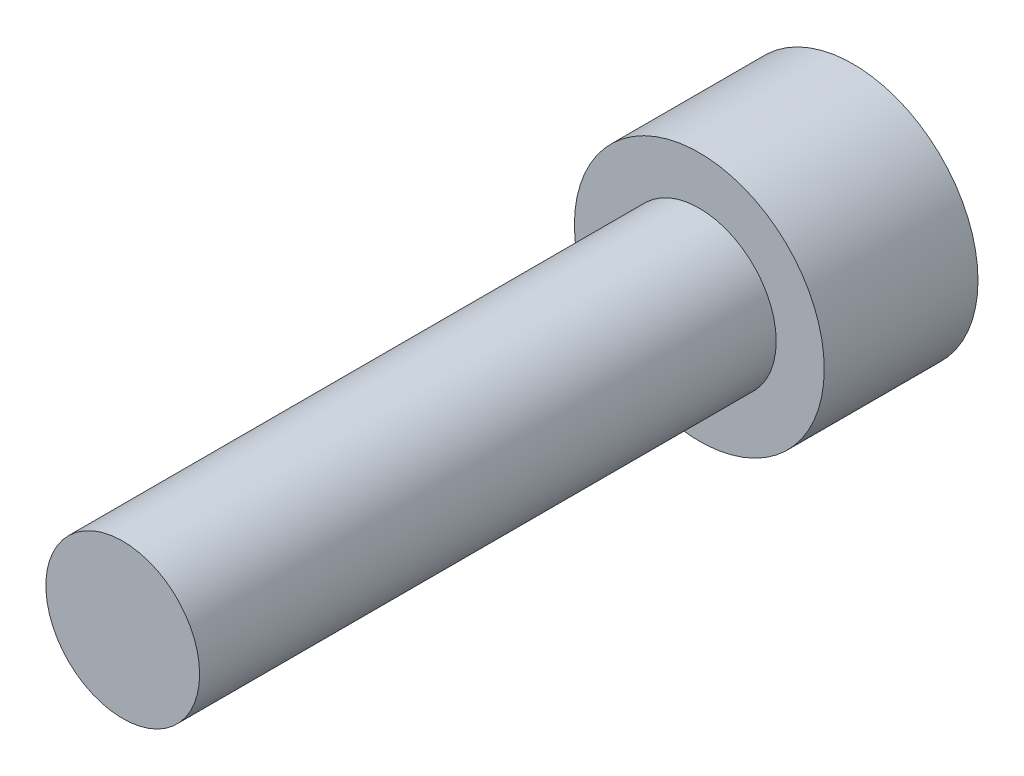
from build123d import *

# Parameters (mm, degrees)
HEX_2_DEPTH = 6


with BuildPart() as part:
    # Sketch6 → Revolve1 (revolve)
    with BuildSketch(Plane(origin=(0, 0, 0), x_dir=(0, 0, -1), z_dir=(1, 0, 0)), mode=Mode.PRIVATE) as revolve1_sk:
        Polygon((-30, 0), (-30, -4), (0, -4), (0, -6.5), (8, -6.5), (8, 0), align=None)
    revolve(revolve1_sk.sketch.rotate(Axis((0, 0, 30), (0, 0, -1)), 270), axis=Axis((0, 0, 30), (0, 0, -1)))

    # Sketch7 → HEX 2 (cut)
    with BuildSketch(Plane(origin=(0, 0, -8), x_dir=(-1, 0, 0), z_dir=(0, 0, -1))):
        Polygon((-3, 1.732050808), (-3, -1.732050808), (0, -3.464101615), (3, -1.732050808), (3, 1.732050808), (0, 3.464101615), align=None)
    extrude(amount=-HEX_2_DEPTH, mode=Mode.SUBTRACT)


solid = part.part
